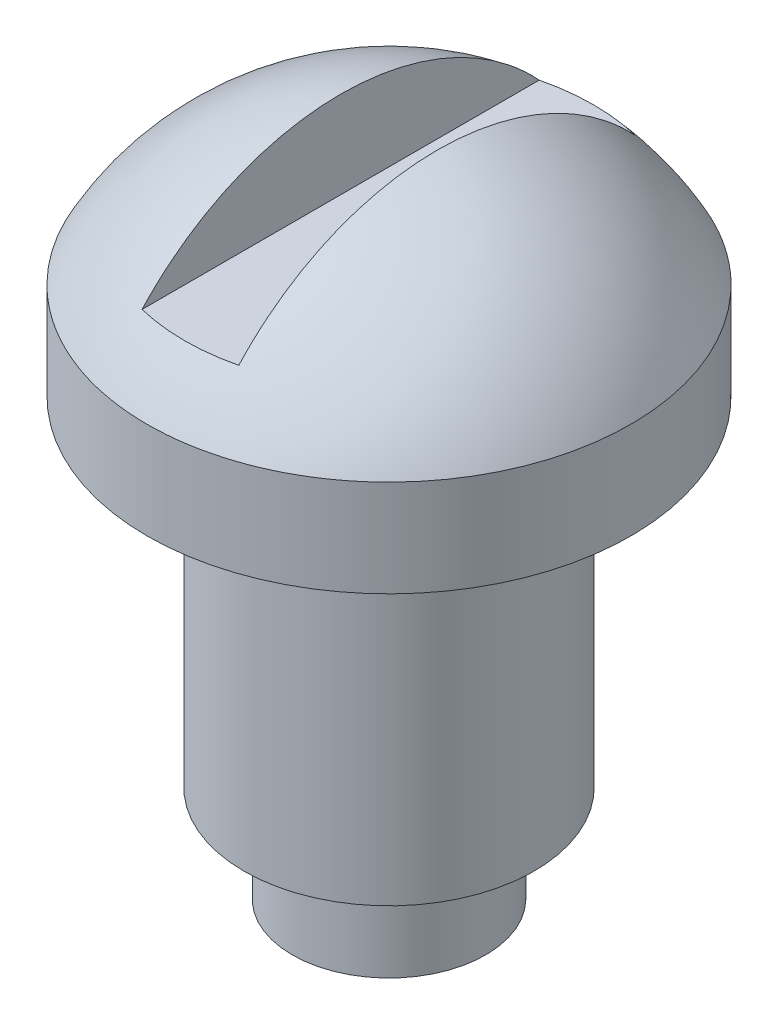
from build123d import *

# Parameters (mm, degrees)
DOME1_FACE_RADIUS  = 5
DOME1_HEIGHT       = 3
SKETCH3_W          = 2
SKETCH3_H          = 4
CUT_EXTRUDE1_DEPTH = 5


with BuildPart() as part:
    # Sketch1 → Revolve1 (revolve)
    with BuildSketch(Plane.XY, mode=Mode.PRIVATE) as revolve1_sk:
        Polygon((0, 0), (2, 0), (2, 2), (3, 2), (3, 9), (5, 9), (5, 11), (0, 11), align=None)
    revolve(revolve1_sk.sketch.rotate(Axis((0, 0, 0), (0, -1, 0)), 90), axis=Axis((0, 0, 0), (0, -1, 0)))

    # Dome1: a dome of height H over a round flat face of radius A is a cap of a sphere of radius (A * A + H * H) / (2 * H)
    dome1_r = (DOME1_FACE_RADIUS * DOME1_FACE_RADIUS + DOME1_HEIGHT * DOME1_HEIGHT) / (2 * DOME1_HEIGHT)
    dome1_base = Plane((0, 11, 0), z_dir=(0, 1, 0))
    with Locations(dome1_base.offset(DOME1_HEIGHT - dome1_r)):
        dome1_ball = Sphere(dome1_r, mode=Mode.PRIVATE)
    add(split(dome1_ball, bisect_by=dome1_base, keep=Keep.TOP, mode=Mode.PRIVATE))

    # Sketch3 → Cut-Extrude1 (cut, symmetric)
    with BuildSketch(Plane.XY):
        with Locations((0, 14.109258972)):
            Rectangle(SKETCH3_W, SKETCH3_H)
    extrude(amount=CUT_EXTRUDE1_DEPTH, both=True, mode=Mode.SUBTRACT)


solid = part.part
